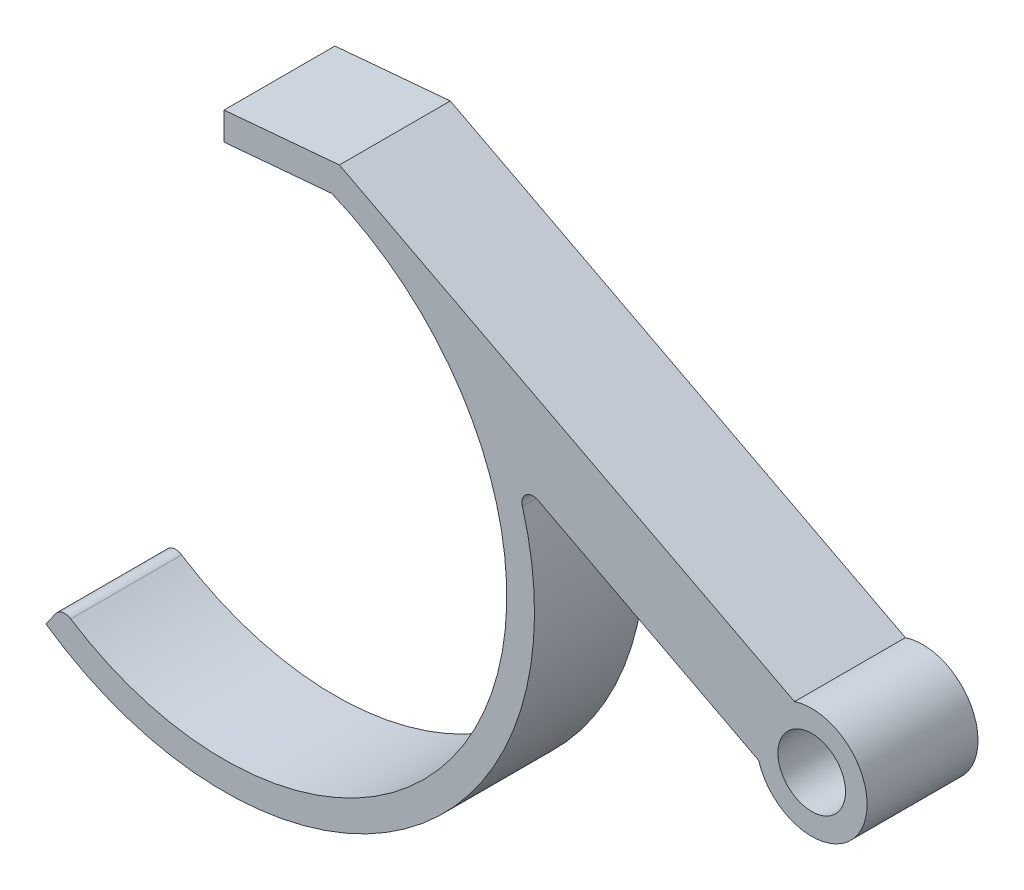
from build123d import *

# Parameters (mm, degrees)
SKETCH1_R           = 3.05
BOSS_EXTRUDE1_DEPTH = 10


with BuildPart() as part:
    # Sketch1 → Boss-Extrude1 (new body)
    with BuildSketch(Plane.XY):
        with BuildLine():
            ThreePointArc((28.329656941, 8.91207688), (27.234499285, 8.799504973), (26.90649761, 7.748573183))
            ThreePointArc((26.90649761, 7.748573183), (16.272694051, -22.785948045), (-16.060140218, -22.93625724))
            Line((-16.060140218, -22.93625724), (-15.188949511, -21.692067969))
            ThreePointArc((-15.188949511, -21.692067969), (-14.561999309, -21.284288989), (-13.827540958, -21.425431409))
            ThreePointArc((-13.827540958, -21.425431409), (22.596458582, -11.81736263), (9.708826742, 23.579412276))
            Line((9.708826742, 23.579412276), (0, 22.73))
            Line((0, 22.73), (0, 25.239549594))
            Line((0, 25.239549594), (10.403277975, 26.14971848))
            Line((10.403277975, 26.14971848), (12.595160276, 25.007237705))
            Line((12.595160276, 25.007237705), (13.286260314, 24.647013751))
            Line((13.286260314, 24.647013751), (51.451346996, 4.754121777))
            ThreePointArc((51.451346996, 4.754121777), (57.433844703, -2.311064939), (48.215856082, -1.453260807))
            Line((48.215856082, -1.453260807), (28.329656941, 8.91207688))
        make_face()
        with Locations((53, 0)):
            Circle(SKETCH1_R, mode=Mode.SUBTRACT)
    extrude(amount=BOSS_EXTRUDE1_DEPTH)


solid = part.part
